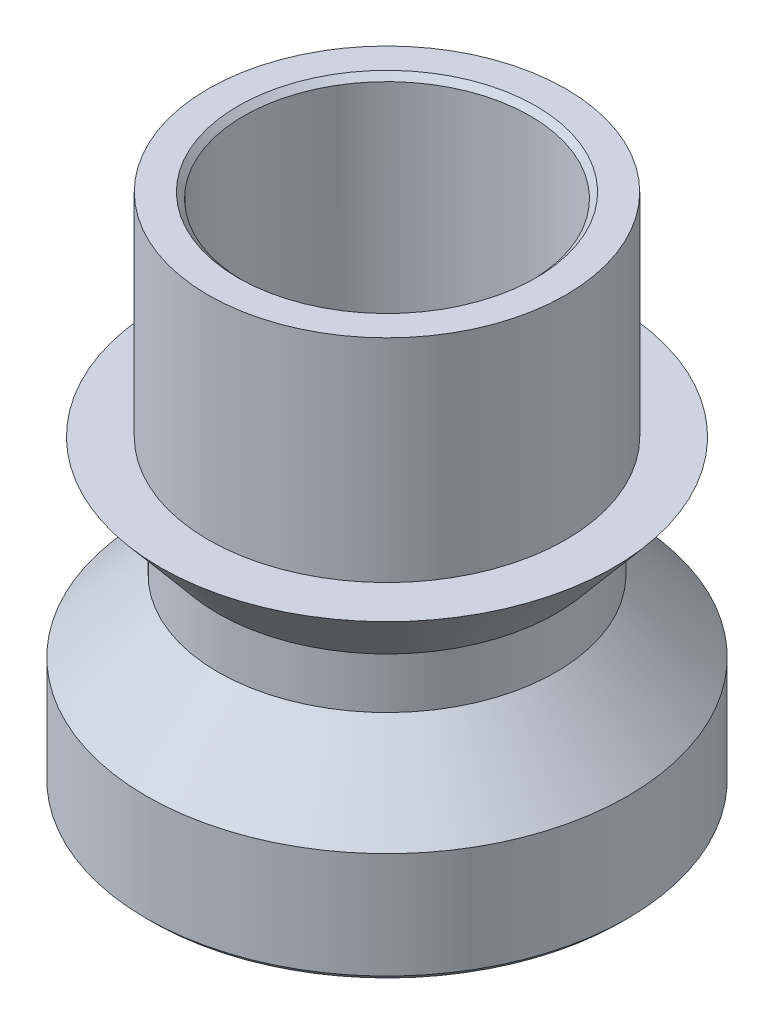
ISO-10303-21;
HEADER;
FILE_DESCRIPTION(('STEP AP214'),'2;1');
FILE_NAME('part.step','',(''),(''),'','','');
FILE_SCHEMA(('AUTOMOTIVE_DESIGN { 1 0 10303 214 1 1 1 1 }'));
ENDSEC;
DATA;
#1=APPLICATION_CONTEXT('core data for automotive mechanical design processes');
#2=APPLICATION_PROTOCOL_DEFINITION('international standard','automotive_design',2000,#1);
#3=PRODUCT_CONTEXT('',#1,'mechanical');
#4=PRODUCT('Part','Part','',(#3));
#5=PRODUCT_RELATED_PRODUCT_CATEGORY('part','',(#4));
#6=PRODUCT_DEFINITION_FORMATION('','',#4);
#7=PRODUCT_DEFINITION_CONTEXT('part definition',#1,'design');
#8=PRODUCT_DEFINITION('design','',#6,#7);
#9=PRODUCT_DEFINITION_SHAPE('','',#8);
#10=(LENGTH_UNIT() NAMED_UNIT(*) SI_UNIT(.MILLI.,.METRE.));
#11=(NAMED_UNIT(*) PLANE_ANGLE_UNIT() SI_UNIT($,.RADIAN.));
#12=(NAMED_UNIT(*) SI_UNIT($,.STERADIAN.) SOLID_ANGLE_UNIT());
#13=UNCERTAINTY_MEASURE_WITH_UNIT(LENGTH_MEASURE(1.E-05),#10,'distance_accuracy_value','');
#14=(GEOMETRIC_REPRESENTATION_CONTEXT(3) GLOBAL_UNCERTAINTY_ASSIGNED_CONTEXT((#13)) GLOBAL_UNIT_ASSIGNED_CONTEXT((#10,
#11,#12)) REPRESENTATION_CONTEXT('',''));
#15=CARTESIAN_POINT('',(0.,0.,0.));
#16=DIRECTION('',(0.,0.,1.));
#17=DIRECTION('',(1.,0.,0.));
#18=AXIS2_PLACEMENT_3D('',#15,#16,#17);
#19=CARTESIAN_POINT('',(0.,3.048,0.));
#20=DIRECTION('',(0.,1.,0.));
#21=DIRECTION('',(0.,0.,1.));
#22=AXIS2_PLACEMENT_3D('',#19,#20,#21);
#23=PLANE('',#22);
#24=CARTESIAN_POINT('',(0.,3.048,0.));
#25=DIRECTION('',(0.,1.,0.));
#26=DIRECTION('',(0.,0.,1.));
#27=AXIS2_PLACEMENT_3D('',#24,#25,#26);
#28=CIRCLE('',#27,10.0505756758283);
#29=CARTESIAN_POINT('',(0.,3.048,10.0505756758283));
#30=VERTEX_POINT('',#29);
#31=EDGE_CURVE('E63',#30,#30,#28,.T.);
#32=ORIENTED_EDGE('',*,*,#31,.T.);
#33=EDGE_LOOP('',(#32));
#34=FACE_BOUND('',#33,.T.);
#35=CARTESIAN_POINT('',(0.,3.048,0.));
#36=DIRECTION('',(0.,1.,0.));
#37=DIRECTION('',(0.,0.,1.));
#38=AXIS2_PLACEMENT_3D('',#35,#36,#37);
#39=CIRCLE('',#38,7.9248);
#40=CARTESIAN_POINT('',(0.,3.048,7.9248));
#41=VERTEX_POINT('',#40);
#42=EDGE_CURVE('E67',#41,#41,#39,.T.);
#43=ORIENTED_EDGE('',*,*,#42,.F.);
#44=EDGE_LOOP('',(#43));
#45=FACE_BOUND('',#44,.T.);
#46=ADVANCED_FACE('F31',(#34,#45),#23,.T.);
#47=CARTESIAN_POINT('',(0.,3.048,0.));
#48=DIRECTION('',(0.,-1.,0.));
#49=DIRECTION('',(0.,0.,-1.));
#50=AXIS2_PLACEMENT_3D('',#47,#48,#49);
#51=CYLINDRICAL_SURFACE('',#50,6.35);
#52=CARTESIAN_POINT('',(0.,12.192,0.));
#53=DIRECTION('',(0.,1.,0.));
#54=DIRECTION('',(0.,0.,1.));
#55=AXIS2_PLACEMENT_3D('',#52,#53,#54);
#56=CIRCLE('',#55,6.35);
#57=CARTESIAN_POINT('',(0.,12.192,-6.35));
#58=VERTEX_POINT('',#57);
#59=EDGE_CURVE('E51',#58,#58,#56,.T.);
#60=CARTESIAN_POINT('',(0.,-10.1219,0.));
#61=DIRECTION('',(0.,-1.,0.));
#62=DIRECTION('',(0.,0.,-1.));
#63=AXIS2_PLACEMENT_3D('',#60,#61,#62);
#64=CIRCLE('',#63,6.35);
#65=CARTESIAN_POINT('',(0.,-10.1219,-6.35));
#66=VERTEX_POINT('',#65);
#67=EDGE_CURVE('E54',#66,#66,#64,.T.);
#68=CARTESIAN_POINT('',(0.,12.192,-6.35));
#69=CARTESIAN_POINT('',(0.,11.9595635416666,-6.35));
#70=CARTESIAN_POINT('',(0.,11.7271270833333,-6.35));
#71=CARTESIAN_POINT('',(0.,11.2622541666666,-6.35));
#72=CARTESIAN_POINT('',(0.,11.0298177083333,-6.35));
#73=CARTESIAN_POINT('',(0.,10.5649447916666,-6.35));
#74=CARTESIAN_POINT('',(0.,10.3325083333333,-6.35));
#75=CARTESIAN_POINT('',(0.,9.86763541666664,-6.35));
#76=CARTESIAN_POINT('',(0.,9.63519895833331,-6.35));
#77=CARTESIAN_POINT('',(0.,9.17032604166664,-6.35));
#78=CARTESIAN_POINT('',(0.,8.93788958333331,-6.35));
#79=CARTESIAN_POINT('',(0.,8.47301666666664,-6.35));
#80=CARTESIAN_POINT('',(0.,8.24058020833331,-6.35));
#81=CARTESIAN_POINT('',(0.,7.77570729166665,-6.35));
#82=CARTESIAN_POINT('',(0.,7.54327083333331,-6.35));
#83=CARTESIAN_POINT('',(0.,7.07839791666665,-6.35));
#84=CARTESIAN_POINT('',(0.,6.84596145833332,-6.35));
#85=CARTESIAN_POINT('',(0.,6.38108854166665,-6.35));
#86=CARTESIAN_POINT('',(0.,6.14865208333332,-6.35));
#87=CARTESIAN_POINT('',(0.,5.68377916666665,-6.35));
#88=CARTESIAN_POINT('',(0.,5.45134270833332,-6.35));
#89=CARTESIAN_POINT('',(0.,4.98646979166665,-6.35));
#90=CARTESIAN_POINT('',(0.,4.75403333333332,-6.35));
#91=CARTESIAN_POINT('',(0.,4.28916041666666,-6.35));
#92=CARTESIAN_POINT('',(0.,4.05672395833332,-6.35));
#93=CARTESIAN_POINT('',(0.,3.59185104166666,-6.35));
#94=CARTESIAN_POINT('',(0.,3.35941458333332,-6.35));
#95=CARTESIAN_POINT('',(0.,2.89454166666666,-6.35));
#96=CARTESIAN_POINT('',(0.,2.66210520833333,-6.35));
#97=CARTESIAN_POINT('',(0.,2.19723229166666,-6.35));
#98=CARTESIAN_POINT('',(0.,1.96479583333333,-6.35));
#99=CARTESIAN_POINT('',(0.,1.49992291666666,-6.35));
#100=CARTESIAN_POINT('',(0.,1.26748645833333,-6.35));
#101=CARTESIAN_POINT('',(0.,0.802613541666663,-6.35));
#102=CARTESIAN_POINT('',(0.,0.57017708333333,-6.35));
#103=CARTESIAN_POINT('',(0.,0.105304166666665,-6.35));
#104=CARTESIAN_POINT('',(0.,-0.127132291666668,-6.35));
#105=CARTESIAN_POINT('',(0.,-0.592005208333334,-6.35));
#106=CARTESIAN_POINT('',(0.,-0.824441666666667,-6.35));
#107=CARTESIAN_POINT('',(0.,-1.28931458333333,-6.35));
#108=CARTESIAN_POINT('',(0.,-1.52175104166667,-6.35));
#109=CARTESIAN_POINT('',(0.,-1.98662395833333,-6.35));
#110=CARTESIAN_POINT('',(0.,-2.21906041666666,-6.35));
#111=CARTESIAN_POINT('',(0.,-2.68393333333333,-6.35));
#112=CARTESIAN_POINT('',(0.,-2.91636979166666,-6.35));
#113=CARTESIAN_POINT('',(0.,-3.38124270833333,-6.35));
#114=CARTESIAN_POINT('',(0.,-3.61367916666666,-6.35));
#115=CARTESIAN_POINT('',(0.,-4.07855208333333,-6.35));
#116=CARTESIAN_POINT('',(0.,-4.31098854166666,-6.35));
#117=CARTESIAN_POINT('',(0.,-4.77586145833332,-6.35));
#118=CARTESIAN_POINT('',(0.,-5.00829791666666,-6.35));
#119=CARTESIAN_POINT('',(0.,-5.47317083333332,-6.35));
#120=CARTESIAN_POINT('',(0.,-5.70560729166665,-6.35));
#121=CARTESIAN_POINT('',(0.,-6.17048020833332,-6.35));
#122=CARTESIAN_POINT('',(0.,-6.40291666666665,-6.35));
#123=CARTESIAN_POINT('',(0.,-6.86778958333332,-6.35));
#124=CARTESIAN_POINT('',(0.,-7.10022604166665,-6.35));
#125=CARTESIAN_POINT('',(0.,-7.56509895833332,-6.35));
#126=CARTESIAN_POINT('',(0.,-7.79753541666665,-6.35));
#127=CARTESIAN_POINT('',(0.,-8.26240833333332,-6.35));
#128=CARTESIAN_POINT('',(0.,-8.49484479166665,-6.35));
#129=CARTESIAN_POINT('',(0.,-8.95971770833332,-6.35));
#130=CARTESIAN_POINT('',(0.,-9.19215416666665,-6.35));
#131=CARTESIAN_POINT('',(0.,-9.65702708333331,-6.35));
#132=CARTESIAN_POINT('',(0.,-9.88946354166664,-6.35));
#133=CARTESIAN_POINT('',(0.,-10.1219,-6.35));
#134=B_SPLINE_CURVE_WITH_KNOTS('',3,(#68,#69,#70,#71,#72,#73,#74,#75,#76,#77,#78,#79,#80,#81,
#82,#83,#84,#85,#86,#87,#88,#89,#90,#91,#92,#93,#94,#95,#96,#97,#98,#99,#100,#101,#102,#103,
#104,#105,#106,#107,#108,#109,#110,#111,#112,#113,#114,#115,#116,#117,#118,#119,#120,#121,#122,
#123,#124,#125,#126,#127,#128,#129,#130,#131,#132,#133),.UNSPECIFIED.,.F.,.F.,(4,2,2,2,2,2,2,2,
2,2,2,2,2,2,2,2,2,2,2,2,2,2,2,2,2,2,2,2,2,2,2,2,4),(0.,0.697309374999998,1.39461875,
2.09192812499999,2.78923749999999,3.48654687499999,4.18385624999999,4.88116562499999,
5.57847499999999,6.27578437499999,6.97309374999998,7.67040312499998,8.36771249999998,
9.06502187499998,9.76233124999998,10.459640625,11.15695,11.854259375,12.55156875,13.248878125,
13.9461875,14.643496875,15.34080625,16.038115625,16.735425,17.432734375,18.13004375,
18.827353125,19.5246625,20.221971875,20.91928125,21.616590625,22.3139),.UNSPECIFIED.);
#135=EDGE_CURVE('BSEAM95',#58,#66,#134,.T.);
#136=ORIENTED_EDGE('',*,*,#59,.T.);
#137=ORIENTED_EDGE('',*,*,#67,.T.);
#138=ORIENTED_EDGE('',*,*,#135,.T.);
#139=ORIENTED_EDGE('',*,*,#135,.F.);
#140=EDGE_LOOP('',(#136,#138,#137,#139));
#141=FACE_BOUND('',#140,.T.);
#142=ADVANCED_FACE('F95',(#141),#51,.F.);
#143=CARTESIAN_POINT('',(0.,12.446,0.));
#144=DIRECTION('',(0.,1.,0.));
#145=DIRECTION('',(0.,0.,1.));
#146=AXIS2_PLACEMENT_3D('',#143,#144,#145);
#147=PLANE('',#146);
#148=CARTESIAN_POINT('',(0.,12.446,0.));
#149=DIRECTION('',(0.,1.,0.));
#150=DIRECTION('',(0.,0.,1.));
#151=AXIS2_PLACEMENT_3D('',#148,#149,#150);
#152=CIRCLE('',#151,6.60400000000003);
#153=CARTESIAN_POINT('',(0.,12.446,6.60400000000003));
#154=VERTEX_POINT('',#153);
#155=EDGE_CURVE('E46',#154,#154,#152,.F.);
#156=ORIENTED_EDGE('',*,*,#155,.T.);
#157=EDGE_LOOP('',(#156));
#158=FACE_BOUND('',#157,.T.);
#159=CARTESIAN_POINT('',(0.,12.446,0.));
#160=DIRECTION('',(0.,1.,0.));
#161=DIRECTION('',(0.,0.,1.));
#162=AXIS2_PLACEMENT_3D('',#159,#160,#161);
#163=CIRCLE('',#162,7.9248);
#164=CARTESIAN_POINT('',(0.,12.446,7.9248));
#165=VERTEX_POINT('',#164);
#166=EDGE_CURVE('E66',#165,#165,#163,.T.);
#167=ORIENTED_EDGE('',*,*,#166,.T.);
#168=EDGE_LOOP('',(#167));
#169=FACE_BOUND('',#168,.T.);
#170=ADVANCED_FACE('F100',(#158,#169),#147,.T.);
#171=CARTESIAN_POINT('',(0.,12.446,0.));
#172=DIRECTION('',(0.,-1.,0.));
#173=DIRECTION('',(0.,0.,-1.));
#174=AXIS2_PLACEMENT_3D('',#171,#172,#173);
#175=CYLINDRICAL_SURFACE('',#174,7.9248);
#176=ORIENTED_EDGE('',*,*,#166,.F.);
#177=EDGE_LOOP('',(#176));
#178=FACE_BOUND('',#177,.T.);
#179=ORIENTED_EDGE('',*,*,#42,.T.);
#180=EDGE_LOOP('',(#179));
#181=FACE_BOUND('',#180,.T.);
#182=ADVANCED_FACE('F89',(#178,#181),#175,.T.);
#183=CARTESIAN_POINT('',(0.,3.78381765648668,0.));
#184=DIRECTION('',(0.,1.,0.));
#185=DIRECTION('',(0.,0.,1.));
#186=AXIS2_PLACEMENT_3D('',#183,#184,#185);
#187=CONICAL_SURFACE('',#186,10.668,0.698131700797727);
#188=CARTESIAN_POINT('',(0.,0.,0.));
#189=DIRECTION('',(0.,1.,0.));
#190=DIRECTION('',(0.,0.,1.));
#191=AXIS2_PLACEMENT_3D('',#188,#189,#190);
#192=CIRCLE('',#191,7.49299999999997);
#193=CARTESIAN_POINT('',(0.,0.,7.49299999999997));
#194=VERTEX_POINT('',#193);
#195=EDGE_CURVE('E60',#194,#194,#192,.F.);
#196=ORIENTED_EDGE('',*,*,#195,.F.);
#197=EDGE_LOOP('',(#196));
#198=FACE_BOUND('',#197,.T.);
#199=ORIENTED_EDGE('',*,*,#31,.F.);
#200=EDGE_LOOP('',(#199));
#201=FACE_BOUND('',#200,.T.);
#202=ADVANCED_FACE('F83',(#198,#201),#187,.T.);
#203=CARTESIAN_POINT('',(0.,-2.2479,0.));
#204=DIRECTION('',(0.,1.,0.));
#205=DIRECTION('',(0.,0.,1.));
#206=AXIS2_PLACEMENT_3D('',#203,#204,#205);
#207=CYLINDRICAL_SURFACE('',#206,7.49299999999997);
#208=CARTESIAN_POINT('',(0.,-2.2479,0.));
#209=DIRECTION('',(0.,-1.,0.));
#210=DIRECTION('',(0.,0.,-1.));
#211=AXIS2_PLACEMENT_3D('',#208,#209,#210);
#212=CIRCLE('',#211,7.49299999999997);
#213=CARTESIAN_POINT('',(0.,-2.2479,-7.49299999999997));
#214=VERTEX_POINT('',#213);
#215=EDGE_CURVE('E70',#214,#214,#212,.T.);
#216=ORIENTED_EDGE('',*,*,#215,.F.);
#217=EDGE_LOOP('',(#216));
#218=FACE_BOUND('',#217,.T.);
#219=ORIENTED_EDGE('',*,*,#195,.T.);
#220=EDGE_LOOP('',(#219));
#221=FACE_BOUND('',#220,.T.);
#222=ADVANCED_FACE('F79',(#218,#221),#207,.T.);
#223=CARTESIAN_POINT('',(0.,-10.3759,0.));
#224=DIRECTION('',(0.,-1.,0.));
#225=DIRECTION('',(0.,0.,-1.));
#226=AXIS2_PLACEMENT_3D('',#223,#224,#225);
#227=PLANE('',#226);
#228=CARTESIAN_POINT('',(0.,-10.3759,0.));
#229=DIRECTION('',(0.,-1.,0.));
#230=DIRECTION('',(0.,0.,-1.));
#231=AXIS2_PLACEMENT_3D('',#228,#229,#230);
#232=CIRCLE('',#231,6.60400000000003);
#233=CARTESIAN_POINT('',(0.,-10.3759,-6.60400000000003));
#234=VERTEX_POINT('',#233);
#235=EDGE_CURVE('E38',#234,#234,#232,.F.);
#236=ORIENTED_EDGE('',*,*,#235,.T.);
#237=EDGE_LOOP('',(#236));
#238=FACE_BOUND('',#237,.T.);
#239=CARTESIAN_POINT('',(0.,-10.3759,0.));
#240=DIRECTION('',(0.,-1.,0.));
#241=DIRECTION('',(0.,0.,-1.));
#242=AXIS2_PLACEMENT_3D('',#239,#240,#241);
#243=CIRCLE('',#242,10.414);
#244=CARTESIAN_POINT('',(0.,-10.3759,-10.414));
#245=VERTEX_POINT('',#244);
#246=EDGE_CURVE('E42',#245,#245,#243,.T.);
#247=ORIENTED_EDGE('',*,*,#246,.T.);
#248=EDGE_LOOP('',(#247));
#249=FACE_BOUND('',#248,.T.);
#250=ADVANCED_FACE('F82',(#238,#249),#227,.T.);
#251=CARTESIAN_POINT('',(0.,-10.3759,0.));
#252=DIRECTION('',(0.,1.,0.));
#253=DIRECTION('',(0.,0.,1.));
#254=AXIS2_PLACEMENT_3D('',#251,#252,#253);
#255=CYLINDRICAL_SURFACE('',#254,10.668);
#256=CARTESIAN_POINT('',(0.,-10.1219,0.));
#257=DIRECTION('',(0.,-1.,0.));
#258=DIRECTION('',(0.,0.,-1.));
#259=AXIS2_PLACEMENT_3D('',#256,#257,#258);
#260=CIRCLE('',#259,10.668);
#261=CARTESIAN_POINT('',(0.,-10.1219,-10.668));
#262=VERTEX_POINT('',#261);
#263=EDGE_CURVE('E10',#262,#262,#260,.F.);
#264=ORIENTED_EDGE('',*,*,#263,.T.);
#265=EDGE_LOOP('',(#264));
#266=FACE_BOUND('',#265,.T.);
#267=CARTESIAN_POINT('',(0.,-5.42289999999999,0.));
#268=DIRECTION('',(0.,-1.,0.));
#269=DIRECTION('',(0.,0.,-1.));
#270=AXIS2_PLACEMENT_3D('',#267,#268,#269);
#271=CIRCLE('',#270,10.668);
#272=CARTESIAN_POINT('',(0.,-5.42289999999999,-10.668));
#273=VERTEX_POINT('',#272);
#274=EDGE_CURVE('E57',#273,#273,#271,.T.);
#275=ORIENTED_EDGE('',*,*,#274,.T.);
#276=EDGE_LOOP('',(#275));
#277=FACE_BOUND('',#276,.T.);
#278=ADVANCED_FACE('F116',(#266,#277),#255,.T.);
#279=CARTESIAN_POINT('',(0.,-5.42289999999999,0.));
#280=DIRECTION('',(0.,-1.,0.));
#281=DIRECTION('',(0.,0.,-1.));
#282=AXIS2_PLACEMENT_3D('',#279,#280,#281);
#283=CONICAL_SURFACE('',#282,10.668,0.785398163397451);
#284=ORIENTED_EDGE('',*,*,#215,.T.);
#285=EDGE_LOOP('',(#284));
#286=FACE_BOUND('',#285,.T.);
#287=ORIENTED_EDGE('',*,*,#274,.F.);
#288=EDGE_LOOP('',(#287));
#289=FACE_BOUND('',#288,.T.);
#290=ADVANCED_FACE('F76',(#286,#289),#283,.T.);
#291=CARTESIAN_POINT('',(0.,12.192,0.));
#292=DIRECTION('',(0.,1.,0.));
#293=DIRECTION('',(0.,0.,1.));
#294=AXIS2_PLACEMENT_3D('',#291,#292,#293);
#295=CONICAL_SURFACE('',#294,6.35,0.78539816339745);
#296=ORIENTED_EDGE('',*,*,#155,.F.);
#297=EDGE_LOOP('',(#296));
#298=FACE_BOUND('',#297,.T.);
#299=ORIENTED_EDGE('',*,*,#59,.F.);
#300=EDGE_LOOP('',(#299));
#301=FACE_BOUND('',#300,.T.);
#302=ADVANCED_FACE('F115',(#298,#301),#295,.F.);
#303=CARTESIAN_POINT('',(0.,-10.1219,0.));
#304=DIRECTION('',(0.,-1.,0.));
#305=DIRECTION('',(0.,0.,-1.));
#306=AXIS2_PLACEMENT_3D('',#303,#304,#305);
#307=CONICAL_SURFACE('',#306,6.35,0.785398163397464);
#308=ORIENTED_EDGE('',*,*,#235,.F.);
#309=EDGE_LOOP('',(#308));
#310=FACE_BOUND('',#309,.T.);
#311=ORIENTED_EDGE('',*,*,#67,.F.);
#312=EDGE_LOOP('',(#311));
#313=FACE_BOUND('',#312,.T.);
#314=ADVANCED_FACE('F118',(#310,#313),#307,.F.);
#315=CARTESIAN_POINT('',(0.,-10.3759,0.));
#316=DIRECTION('',(0.,1.,0.));
#317=DIRECTION('',(0.,0.,1.));
#318=AXIS2_PLACEMENT_3D('',#315,#316,#317);
#319=CONICAL_SURFACE('',#318,10.414,0.785398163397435);
#320=ORIENTED_EDGE('',*,*,#263,.F.);
#321=EDGE_LOOP('',(#320));
#322=FACE_BOUND('',#321,.T.);
#323=ORIENTED_EDGE('',*,*,#246,.F.);
#324=EDGE_LOOP('',(#323));
#325=FACE_BOUND('',#324,.T.);
#326=ADVANCED_FACE('F33',(#322,#325),#319,.T.);
#327=CLOSED_SHELL('',(#46,#142,#170,#182,#202,#222,#250,#278,#290,#302,#314,#326));
#328=MANIFOLD_SOLID_BREP('B2',#327);
#329=ADVANCED_BREP_SHAPE_REPRESENTATION('',(#18,#328),#14);
#330=SHAPE_DEFINITION_REPRESENTATION(#9,#329);
ENDSEC;
END-ISO-10303-21;
